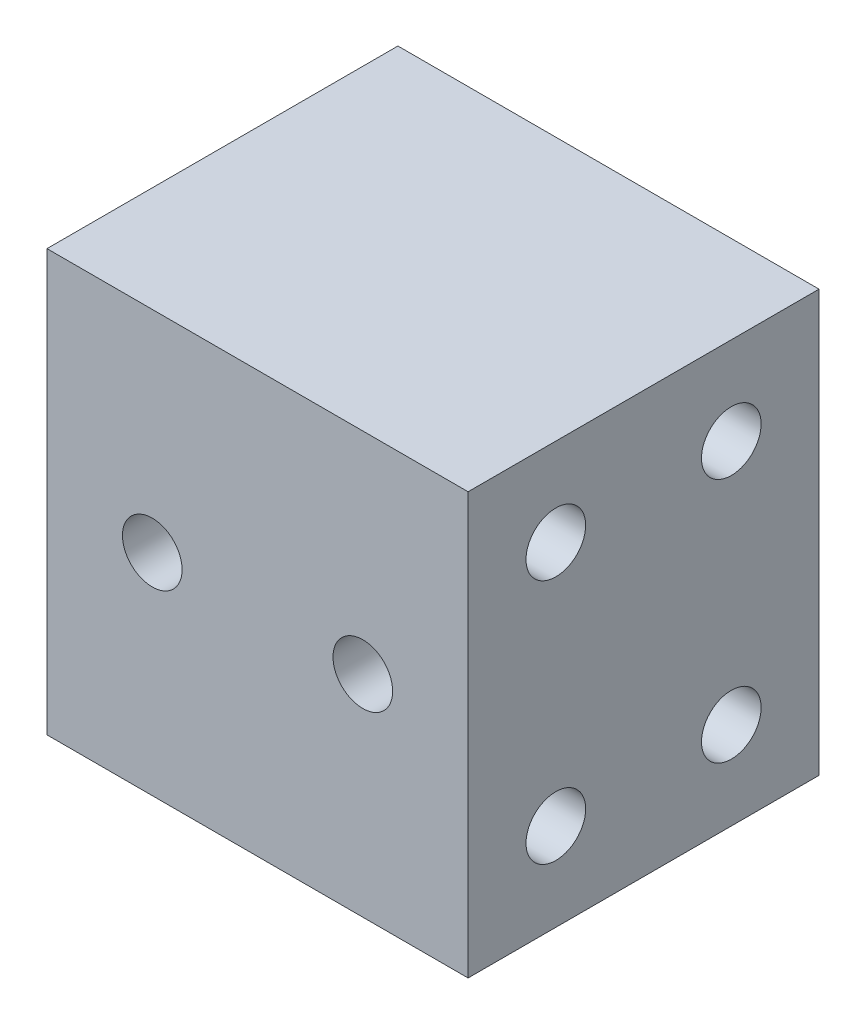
from build123d import *

# Parameters (mm, degrees)
SKETCH_1_W                                          = 24
SKETCH_1_H                                          = 24
SKETCH_1_R                                          = 1.7
WRIST_SPACER_W20_DEPTH                              = 20
GRIPPER_ADAPTER_M3_14X10_NOT_SG90_DIRECT_DEPTH      = 27.229754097
GRIPPER_ADAPTER_M3_14X10_NOT_SG90_DIRECT_DEPTH_BACK = 27.229754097
SKETCH_2_R                                          = 1.7


with BuildPart() as part:
    # Sketch 1 → Wrist_spacer_W20 (new body)
    with BuildSketch(Plane.XY):
        Rectangle(SKETCH_1_W, SKETCH_1_H)
        with Locations((-6, 0)):
            Circle(SKETCH_1_R, mode=Mode.SUBTRACT)
        with Locations((6, 0)):
            Circle(SKETCH_1_R, mode=Mode.SUBTRACT)
    extrude(amount=WRIST_SPACER_W20_DEPTH)

    # Sketch 2 → Gripper_adapter_M3_14x10_NOT_SG90_DIRECT (cut, two sides: drawn at the far end of the back side and taken through both)
    with BuildSketch(Plane(origin=(0, 0, 0), x_dir=(0, 0, -1), z_dir=(1, 0, 0)).offset(-GRIPPER_ADAPTER_M3_14X10_NOT_SG90_DIRECT_DEPTH_BACK)):
        with Locations((-5, -7)):
            Circle(SKETCH_2_R)
        with Locations((-15, -7)):
            Circle(SKETCH_2_R)
        with Locations((-5, 7)):
            Circle(SKETCH_2_R)
        with Locations((-15, 7)):
            Circle(SKETCH_2_R)
    extrude(amount=GRIPPER_ADAPTER_M3_14X10_NOT_SG90_DIRECT_DEPTH + GRIPPER_ADAPTER_M3_14X10_NOT_SG90_DIRECT_DEPTH_BACK, mode=Mode.SUBTRACT)


solid = part.part
